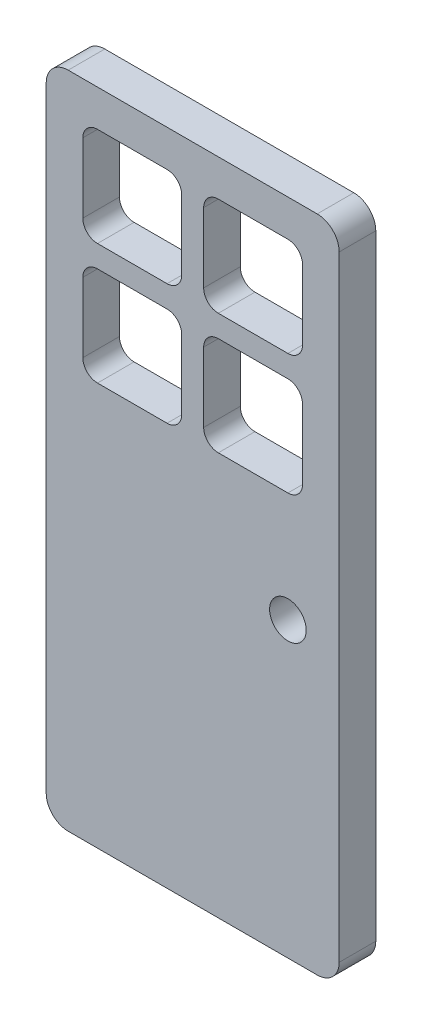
from build123d import *

# Parameters (mm, degrees)
SKETCH1_W           = 40
SKETCH1_H           = 90
BOSS_EXTRUDE1_DEPTH = 2.5
FILLET1_R           = 3
SKETCH2_W           = 30
SKETCH2_H           = 30
CUT_EXTRUDE1_DEPTH  = 50.497474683
BOSS_EXTRUDE2_DEPTH = 5
FILLET2_R           = 2
SKETCH4_R           = 2.5
CUT_EXTRUDE2_DEPTH  = 50.497474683


with BuildPart() as part:
    # Sketch1 → Boss-Extrude1 (new, symmetric)
    with BuildSketch(Plane.XY):
        Rectangle(SKETCH1_W, SKETCH1_H)
    extrude(amount=BOSS_EXTRUDE1_DEPTH, both=True)

    # Fillet1
    fillet1_edges = [part.edges().sort_by_distance(p)[0] for p in [
        (-20, 45, 0),
        (20, 45, 0),
        (20, -45, 0),
        (-20, -45, 0),
    ]]
    fillet(fillet1_edges, radius=FILLET1_R)

    # Sketch2 → Cut-Extrude1 (cut, through all)
    with BuildSketch(Plane.XY.offset(2.5)):
        with Locations((0, 25)):
            Rectangle(SKETCH2_W, SKETCH2_H)
    extrude(amount=-CUT_EXTRUDE1_DEPTH, mode=Mode.SUBTRACT)

    # Sketch3 → Boss-Extrude2 (add)
    with BuildSketch(Plane.XY.offset(2.5)):
        Polygon((-1.5, 10), (1.5, 10), (1.5, 23.5), (15, 23.5), (15, 26.5), (1.5, 26.5), (1.5, 40), (-1.5, 40), (-1.5, 26.5), (-15, 26.5), (-15, 23.5), (-1.5, 23.5), align=None)
    extrude(amount=-BOSS_EXTRUDE2_DEPTH)

    # Fillet2
    fillet2_edges = [part.edges().sort_by_distance(p)[0] for p in [
        (-15, 10, 0),
        (-15, 40, 0),
        (15, 40, 0),
        (15, 10, 0),
        (-1.5, 10, 0),
        (1.5, 10, 0),
        (1.5, 23.5, 0),
        (15, 23.5, 0),
        (15, 26.5, 0),
        (1.5, 26.5, 0),
        (1.5, 40, 0),
        (-1.5, 40, 0),
        (-1.5, 26.5, 0),
        (-15, 26.5, 0),
        (-15, 23.5, 0),
        (-1.5, 23.5, 0),
    ]]
    fillet(fillet2_edges, radius=FILLET2_R)

    # Sketch4 → Cut-Extrude2 (cut, through all)
    with BuildSketch(Plane.XY.offset(2.5)):
        with Locations((13, -5)):
            Circle(SKETCH4_R)
    extrude(amount=-CUT_EXTRUDE2_DEPTH, mode=Mode.SUBTRACT)


solid = part.part
